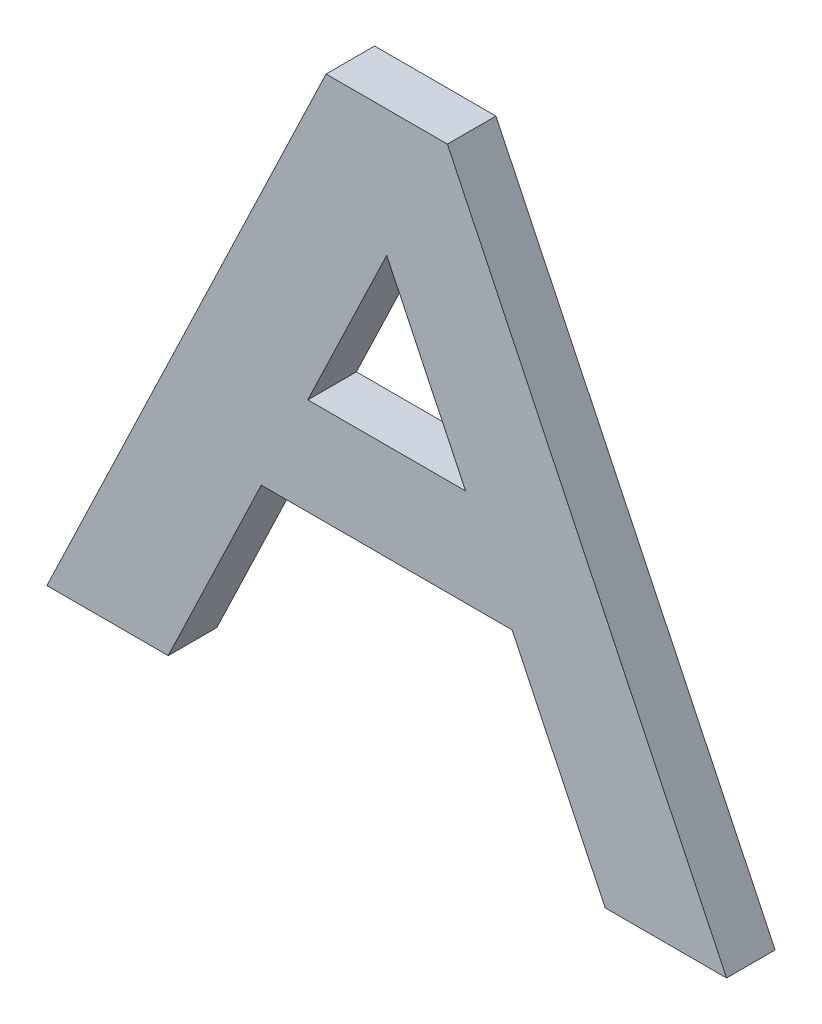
from build123d import *

# Parameters (mm, degrees)
EXTRUDE1_DEPTH = 6.35


with BuildPart() as part:
    # Sketch1 → Extrude1 (new body)
    with BuildSketch(Plane.XY):
        Polygon((-7.9375, 76.2), (7.9375, 76.2), (44.45, 0), (28.575, 0), (16.404166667, 25.4), (-16.404166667, 25.4), (-28.575, 0), (-44.45, 0), align=None)
        Polygon((0, 59.634782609), (10.31875, 38.1), (-10.31875, 38.1), align=None, mode=Mode.SUBTRACT)
    extrude(amount=EXTRUDE1_DEPTH)


solid = part.part
